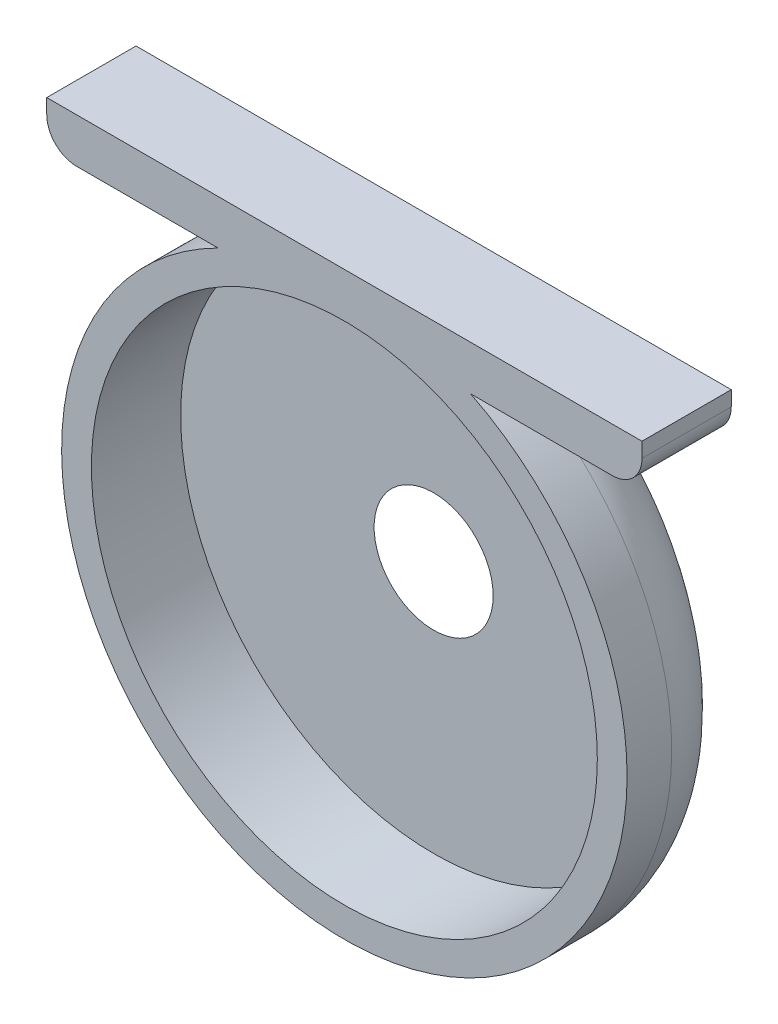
ISO-10303-21;
HEADER;
FILE_DESCRIPTION(('STEP AP214'),'2;1');
FILE_NAME('part.step','',(''),(''),'','','');
FILE_SCHEMA(('AUTOMOTIVE_DESIGN { 1 0 10303 214 1 1 1 1 }'));
ENDSEC;
DATA;
#1=APPLICATION_CONTEXT('core data for automotive mechanical design processes');
#2=APPLICATION_PROTOCOL_DEFINITION('international standard','automotive_design',2000,#1);
#3=PRODUCT_CONTEXT('',#1,'mechanical');
#4=PRODUCT('Part','Part','',(#3));
#5=PRODUCT_RELATED_PRODUCT_CATEGORY('part','',(#4));
#6=PRODUCT_DEFINITION_FORMATION('','',#4);
#7=PRODUCT_DEFINITION_CONTEXT('part definition',#1,'design');
#8=PRODUCT_DEFINITION('design','',#6,#7);
#9=PRODUCT_DEFINITION_SHAPE('','',#8);
#10=(LENGTH_UNIT() NAMED_UNIT(*) SI_UNIT(.MILLI.,.METRE.));
#11=(NAMED_UNIT(*) PLANE_ANGLE_UNIT() SI_UNIT($,.RADIAN.));
#12=(NAMED_UNIT(*) SI_UNIT($,.STERADIAN.) SOLID_ANGLE_UNIT());
#13=UNCERTAINTY_MEASURE_WITH_UNIT(LENGTH_MEASURE(1.E-05),#10,'distance_accuracy_value','');
#14=(GEOMETRIC_REPRESENTATION_CONTEXT(3) GLOBAL_UNCERTAINTY_ASSIGNED_CONTEXT((#13)) GLOBAL_UNIT_ASSIGNED_CONTEXT((#10,
#11,#12)) REPRESENTATION_CONTEXT('',''));
#15=CARTESIAN_POINT('',(0.,0.,0.));
#16=DIRECTION('',(0.,0.,1.));
#17=DIRECTION('',(1.,0.,0.));
#18=AXIS2_PLACEMENT_3D('',#15,#16,#17);
#19=CARTESIAN_POINT('',(0.,0.,6.));
#20=DIRECTION('',(0.,0.,1.));
#21=DIRECTION('',(1.,0.,0.));
#22=AXIS2_PLACEMENT_3D('',#19,#20,#21);
#23=PLANE('',#22);
#24=CARTESIAN_POINT('',(0.,0.,6.));
#25=DIRECTION('',(0.,0.,1.));
#26=DIRECTION('',(1.,0.,0.));
#27=AXIS2_PLACEMENT_3D('',#24,#25,#26);
#28=CIRCLE('',#27,17.);
#29=CARTESIAN_POINT('',(17.,0.,6.));
#30=VERTEX_POINT('',#29);
#31=EDGE_CURVE('E148',#30,#30,#28,.T.);
#32=ORIENTED_EDGE('',*,*,#31,.F.);
#33=EDGE_LOOP('',(#32));
#34=FACE_BOUND('',#33,.T.);
#35=DIRECTION('',(0.,1.,0.));
#36=VECTOR('',#35,1.);
#37=CARTESIAN_POINT('',(-20.,17.,6.));
#38=LINE('',#37,#36);
#39=CARTESIAN_POINT('',(-20.,19.,6.));
#40=VERTEX_POINT('',#39);
#41=CARTESIAN_POINT('',(-20.,20.,6.));
#42=VERTEX_POINT('',#41);
#43=EDGE_CURVE('E102',#40,#42,#38,.T.);
#44=ORIENTED_EDGE('',*,*,#43,.F.);
#45=CARTESIAN_POINT('',(-18.,19.,6.));
#46=DIRECTION('',(0.,0.,1.));
#47=DIRECTION('',(1.,0.,0.));
#48=AXIS2_PLACEMENT_3D('',#45,#46,#47);
#49=CIRCLE('',#48,2.);
#50=CARTESIAN_POINT('',(-18.,17.,6.));
#51=VERTEX_POINT('',#50);
#52=EDGE_CURVE('E55',#40,#51,#49,.T.);
#53=ORIENTED_EDGE('',*,*,#52,.T.);
#54=DIRECTION('',(1.,0.,0.));
#55=VECTOR('',#54,1.);
#56=CARTESIAN_POINT('',(-20.,17.,6.));
#57=LINE('',#56,#55);
#58=CARTESIAN_POINT('',(-8.48528137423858,17.,6.));
#59=VERTEX_POINT('',#58);
#60=EDGE_CURVE('E133',#51,#59,#57,.T.);
#61=ORIENTED_EDGE('',*,*,#60,.T.);
#62=CARTESIAN_POINT('',(0.,0.,6.));
#63=DIRECTION('',(0.,0.,1.));
#64=DIRECTION('',(1.,0.,0.));
#65=AXIS2_PLACEMENT_3D('',#62,#63,#64);
#66=CIRCLE('',#65,19.);
#67=CARTESIAN_POINT('',(8.48528137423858,17.,6.));
#68=VERTEX_POINT('',#67);
#69=EDGE_CURVE('E151',#59,#68,#66,.T.);
#70=ORIENTED_EDGE('',*,*,#69,.T.);
#71=CARTESIAN_POINT('',(18.,17.,6.));
#72=VERTEX_POINT('',#71);
#73=EDGE_CURVE('E132',#68,#72,#57,.T.);
#74=ORIENTED_EDGE('',*,*,#73,.T.);
#75=CARTESIAN_POINT('',(18.,19.,6.));
#76=DIRECTION('',(0.,0.,1.));
#77=DIRECTION('',(1.,0.,0.));
#78=AXIS2_PLACEMENT_3D('',#75,#76,#77);
#79=CIRCLE('',#78,2.);
#80=CARTESIAN_POINT('',(20.,19.,6.));
#81=VERTEX_POINT('',#80);
#82=EDGE_CURVE('E201',#72,#81,#79,.T.);
#83=ORIENTED_EDGE('',*,*,#82,.T.);
#84=DIRECTION('',(0.,1.,0.));
#85=VECTOR('',#84,1.);
#86=CARTESIAN_POINT('',(20.,17.,6.));
#87=LINE('',#86,#85);
#88=CARTESIAN_POINT('',(20.,20.,6.));
#89=VERTEX_POINT('',#88);
#90=EDGE_CURVE('E110',#81,#89,#87,.T.);
#91=ORIENTED_EDGE('',*,*,#90,.T.);
#92=DIRECTION('',(1.,0.,0.));
#93=VECTOR('',#92,1.);
#94=CARTESIAN_POINT('',(-20.,20.,6.));
#95=LINE('',#94,#93);
#96=EDGE_CURVE('E114',#42,#89,#95,.T.);
#97=ORIENTED_EDGE('',*,*,#96,.F.);
#98=EDGE_LOOP('',(#44,#53,#61,#70,#74,#83,#91,#97));
#99=FACE_BOUND('',#98,.T.);
#100=ADVANCED_FACE('F33',(#34,#99),#23,.T.);
#101=CARTESIAN_POINT('',(0.,0.,0.));
#102=DIRECTION('',(0.,0.,1.));
#103=DIRECTION('',(1.,0.,0.));
#104=AXIS2_PLACEMENT_3D('',#101,#102,#103);
#105=PLANE('',#104);
#106=DIRECTION('',(-1.,0.,0.));
#107=VECTOR('',#106,1.);
#108=CARTESIAN_POINT('',(-20.,17.,0.));
#109=LINE('',#108,#107);
#110=CARTESIAN_POINT('',(-5.91607978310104,17.,0.));
#111=VERTEX_POINT('',#110);
#112=CARTESIAN_POINT('',(-18.,17.,0.));
#113=VERTEX_POINT('',#112);
#114=EDGE_CURVE('E135',#111,#113,#109,.T.);
#115=ORIENTED_EDGE('',*,*,#114,.T.);
#116=CARTESIAN_POINT('',(-18.,19.,0.));
#117=DIRECTION('',(0.,0.,1.));
#118=DIRECTION('',(1.,0.,0.));
#119=AXIS2_PLACEMENT_3D('',#116,#117,#118);
#120=CIRCLE('',#119,2.);
#121=CARTESIAN_POINT('',(-20.,19.,0.));
#122=VERTEX_POINT('',#121);
#123=EDGE_CURVE('E11',#113,#122,#120,.F.);
#124=ORIENTED_EDGE('',*,*,#123,.T.);
#125=DIRECTION('',(0.,1.,0.));
#126=VECTOR('',#125,1.);
#127=CARTESIAN_POINT('',(-20.,17.,0.));
#128=LINE('',#127,#126);
#129=CARTESIAN_POINT('',(-20.,20.,0.));
#130=VERTEX_POINT('',#129);
#131=EDGE_CURVE('E137',#122,#130,#128,.T.);
#132=ORIENTED_EDGE('',*,*,#131,.T.);
#133=DIRECTION('',(-1.,0.,0.));
#134=VECTOR('',#133,1.);
#135=CARTESIAN_POINT('',(-20.,20.,0.));
#136=LINE('',#135,#134);
#137=CARTESIAN_POINT('',(20.,20.,0.));
#138=VERTEX_POINT('',#137);
#139=EDGE_CURVE('E124',#138,#130,#136,.T.);
#140=ORIENTED_EDGE('',*,*,#139,.F.);
#141=DIRECTION('',(0.,1.,0.));
#142=VECTOR('',#141,1.);
#143=CARTESIAN_POINT('',(20.,17.,0.));
#144=LINE('',#143,#142);
#145=CARTESIAN_POINT('',(20.,19.,0.));
#146=VERTEX_POINT('',#145);
#147=EDGE_CURVE('E140',#146,#138,#144,.T.);
#148=ORIENTED_EDGE('',*,*,#147,.F.);
#149=CARTESIAN_POINT('',(18.,19.,0.));
#150=DIRECTION('',(0.,0.,1.));
#151=DIRECTION('',(1.,0.,0.));
#152=AXIS2_PLACEMENT_3D('',#149,#150,#151);
#153=CIRCLE('',#152,2.);
#154=CARTESIAN_POINT('',(18.,17.,0.));
#155=VERTEX_POINT('',#154);
#156=EDGE_CURVE('E197',#146,#155,#153,.F.);
#157=ORIENTED_EDGE('',*,*,#156,.T.);
#158=CARTESIAN_POINT('',(5.91607978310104,17.,0.));
#159=VERTEX_POINT('',#158);
#160=EDGE_CURVE('E111',#155,#159,#109,.T.);
#161=ORIENTED_EDGE('',*,*,#160,.T.);
#162=CARTESIAN_POINT('',(0.,0.,0.));
#163=DIRECTION('',(0.,0.,1.));
#164=DIRECTION('',(1.,0.,0.));
#165=AXIS2_PLACEMENT_3D('',#162,#163,#164);
#166=CIRCLE('',#165,18.0000000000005);
#167=EDGE_CURVE('E173',#159,#111,#166,.T.);
#168=ORIENTED_EDGE('',*,*,#167,.T.);
#169=EDGE_LOOP('',(#115,#124,#132,#140,#148,#157,#161,#168));
#170=FACE_BOUND('',#169,.T.);
#171=ADVANCED_FACE('F215',(#170),#105,.F.);
#172=CARTESIAN_POINT('',(0.,0.,6.));
#173=DIRECTION('',(0.,0.,-1.));
#174=DIRECTION('',(-1.,0.,0.));
#175=AXIS2_PLACEMENT_3D('',#172,#173,#174);
#176=CYLINDRICAL_SURFACE('',#175,19.);
#177=DIRECTION('',(0.,0.,-1.));
#178=VECTOR('',#177,1.);
#179=CARTESIAN_POINT('',(-8.48528137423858,17.,6.));
#180=LINE('',#179,#178);
#181=CARTESIAN_POINT('',(-8.48528137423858,17.,3.));
#182=VERTEX_POINT('',#181);
#183=EDGE_CURVE('E144',#59,#182,#180,.T.);
#184=ORIENTED_EDGE('',*,*,#183,.T.);
#185=CARTESIAN_POINT('',(0.,0.,3.));
#186=DIRECTION('',(0.,0.,1.));
#187=DIRECTION('',(1.,0.,0.));
#188=AXIS2_PLACEMENT_3D('',#185,#186,#187);
#189=CIRCLE('',#188,19.);
#190=CARTESIAN_POINT('',(8.48528137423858,17.,3.));
#191=VERTEX_POINT('',#190);
#192=EDGE_CURVE('E159',#182,#191,#189,.T.);
#193=ORIENTED_EDGE('',*,*,#192,.T.);
#194=DIRECTION('',(0.,0.,-1.));
#195=VECTOR('',#194,1.);
#196=CARTESIAN_POINT('',(8.48528137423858,17.,6.));
#197=LINE('',#196,#195);
#198=EDGE_CURVE('E139',#191,#68,#197,.F.);
#199=ORIENTED_EDGE('',*,*,#198,.T.);
#200=ORIENTED_EDGE('',*,*,#69,.F.);
#201=EDGE_LOOP('',(#184,#193,#199,#200));
#202=FACE_BOUND('',#201,.T.);
#203=ADVANCED_FACE('F235',(#202),#176,.T.);
#204=CARTESIAN_POINT('',(0.,0.,6.));
#205=DIRECTION('',(0.,0.,-1.));
#206=DIRECTION('',(-1.,0.,0.));
#207=AXIS2_PLACEMENT_3D('',#204,#205,#206);
#208=CYLINDRICAL_SURFACE('',#207,17.);
#209=CARTESIAN_POINT('',(0.,0.,0.));
#210=DIRECTION('',(0.,0.,1.));
#211=DIRECTION('',(1.,0.,0.));
#212=AXIS2_PLACEMENT_3D('',#209,#210,#211);
#213=CIRCLE('',#212,17.);
#214=CARTESIAN_POINT('',(17.,0.,0.));
#215=VERTEX_POINT('',#214);
#216=EDGE_CURVE('E147',#215,#215,#213,.T.);
#217=ORIENTED_EDGE('',*,*,#216,.F.);
#218=EDGE_LOOP('',(#217));
#219=FACE_BOUND('',#218,.T.);
#220=ORIENTED_EDGE('',*,*,#31,.T.);
#221=EDGE_LOOP('',(#220));
#222=FACE_BOUND('',#221,.T.);
#223=ADVANCED_FACE('F184',(#219,#222),#208,.F.);
#224=CARTESIAN_POINT('',(0.,17.,0.));
#225=DIRECTION('',(0.,-1.,0.));
#226=DIRECTION('',(0.,0.,-1.));
#227=AXIS2_PLACEMENT_3D('',#224,#225,#226);
#228=PLANE('',#227);
#229=ORIENTED_EDGE('',*,*,#60,.F.);
#230=DIRECTION('',(0.,0.,1.));
#231=VECTOR('',#230,1.);
#232=CARTESIAN_POINT('',(-18.,17.,0.));
#233=LINE('',#232,#231);
#234=EDGE_CURVE('E41',#51,#113,#233,.F.);
#235=ORIENTED_EDGE('',*,*,#234,.T.);
#236=ORIENTED_EDGE('',*,*,#114,.F.);
#237=CARTESIAN_POINT('',(-5.91607978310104,17.,0.));
#238=CARTESIAN_POINT('',(-6.04115061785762,17.,0.0548402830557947));
#239=CARTESIAN_POINT('',(-6.16487037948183,17.,0.112928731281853));
#240=CARTESIAN_POINT('',(-6.40892950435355,17.,0.236508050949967));
#241=CARTESIAN_POINT('',(-6.52925971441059,17.,0.302016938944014));
#242=CARTESIAN_POINT('',(-6.76715348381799,17.,0.442211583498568));
#243=CARTESIAN_POINT('',(-6.88464000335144,17.,0.5170294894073));
#244=CARTESIAN_POINT('',(-7.11317187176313,17.,0.675730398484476));
#245=CARTESIAN_POINT('',(-7.22422364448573,17.,0.759604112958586));
#246=CARTESIAN_POINT('',(-7.47230344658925,17.,0.965678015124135));
#247=CARTESIAN_POINT('',(-7.60632686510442,17.,1.09157255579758));
#248=CARTESIAN_POINT('',(-7.85369385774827,17.,1.36158809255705));
#249=CARTESIAN_POINT('',(-7.96713209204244,17.,1.50562021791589));
#250=CARTESIAN_POINT('',(-8.14462595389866,17.,1.77888382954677));
#251=CARTESIAN_POINT('',(-8.2140555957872,17.,1.90459886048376));
#252=CARTESIAN_POINT('',(-8.33136189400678,17.,2.16569931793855));
#253=CARTESIAN_POINT('',(-8.37927661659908,17.,2.30106716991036));
#254=CARTESIAN_POINT('',(-8.43773474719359,17.,2.5309710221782));
#255=CARTESIAN_POINT('',(-8.45544775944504,17.,2.62371658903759));
#256=CARTESIAN_POINT('',(-8.47927282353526,17.,2.81094129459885));
#257=CARTESIAN_POINT('',(-8.48535224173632,17.,2.90542456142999));
#258=CARTESIAN_POINT('',(-8.48528137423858,17.,3.));
#259=B_SPLINE_CURVE_WITH_KNOTS('',3,(#237,#238,#239,#240,#241,#242,#243,#244,#245,#246,#247,
#248,#249,#250,#251,#252,#253,#254,#255,#256,#257,#258),.UNSPECIFIED.,.F.,.F.,(4,2,2,2,2,2,2,2,
2,2,4),(0.,0.409750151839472,0.820517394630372,1.23797847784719,1.65501536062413,
2.20499679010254,2.75238125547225,3.18160653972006,3.61006937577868,3.89264815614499,
4.17601844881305),.UNSPECIFIED.);
#260=EDGE_CURVE('E189',#111,#182,#259,.T.);
#261=ORIENTED_EDGE('',*,*,#260,.T.);
#262=ORIENTED_EDGE('',*,*,#183,.F.);
#263=EDGE_LOOP('',(#229,#235,#236,#261,#262));
#264=FACE_BOUND('',#263,.T.);
#265=ADVANCED_FACE('F178',(#264),#228,.T.);
#266=ORIENTED_EDGE('',*,*,#160,.F.);
#267=DIRECTION('',(0.,0.,-1.));
#268=VECTOR('',#267,1.);
#269=CARTESIAN_POINT('',(18.,17.,0.));
#270=LINE('',#269,#268);
#271=EDGE_CURVE('E199',#155,#72,#270,.F.);
#272=ORIENTED_EDGE('',*,*,#271,.T.);
#273=ORIENTED_EDGE('',*,*,#73,.F.);
#274=ORIENTED_EDGE('',*,*,#198,.F.);
#275=CARTESIAN_POINT('',(8.48528137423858,17.,3.));
#276=CARTESIAN_POINT('',(8.48530327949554,17.,2.93329421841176));
#277=CARTESIAN_POINT('',(8.48229305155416,17.,2.86660007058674));
#278=CARTESIAN_POINT('',(8.47037631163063,17.,2.7337872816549));
#279=CARTESIAN_POINT('',(8.46147404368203,17.,2.6676682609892));
#280=CARTESIAN_POINT('',(8.43803132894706,17.,2.53696546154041));
#281=CARTESIAN_POINT('',(8.42353480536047,17.,2.47237378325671));
#282=CARTESIAN_POINT('',(8.38920466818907,17.,2.34463435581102));
#283=CARTESIAN_POINT('',(8.36937032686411,17.,2.28148680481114));
#284=CARTESIAN_POINT('',(8.30249804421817,17.,2.09509611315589));
#285=CARTESIAN_POINT('',(8.24800785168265,17.,1.97446226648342));
#286=CARTESIAN_POINT('',(8.12245158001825,17.,1.7421514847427));
#287=CARTESIAN_POINT('',(8.05135951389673,17.,1.63048896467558));
#288=CARTESIAN_POINT('',(7.84977058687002,17.,1.35350519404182));
#289=CARTESIAN_POINT('',(7.70904522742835,17.,1.19562745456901));
#290=CARTESIAN_POINT('',(7.40428663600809,17.,0.903308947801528));
#291=CARTESIAN_POINT('',(7.24013269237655,17.,0.76899813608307));
#292=CARTESIAN_POINT('',(6.978247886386,17.,0.580655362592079));
#293=CARTESIAN_POINT('',(6.88598717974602,17.,0.518786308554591));
#294=CARTESIAN_POINT('',(6.69797168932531,17.,0.400527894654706));
#295=CARTESIAN_POINT('',(6.60221593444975,17.,0.344140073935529));
#296=CARTESIAN_POINT('',(6.40925849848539,17.,0.237199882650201));
#297=CARTESIAN_POINT('',(6.31209540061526,17.,0.186577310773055));
#298=CARTESIAN_POINT('',(6.11560991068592,17.,0.0899429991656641));
#299=CARTESIAN_POINT('',(6.01628960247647,17.,0.0439270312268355));
#300=CARTESIAN_POINT('',(5.9160797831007,17.,4.70015516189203E-13));
#301=B_SPLINE_CURVE_WITH_KNOTS('',3,(#275,#276,#277,#278,#279,#280,#281,#282,#283,#284,#285,
#286,#287,#288,#289,#290,#291,#292,#293,#294,#295,#296,#297,#298,#299,#300),.UNSPECIFIED.,.F.,
.F.,(4,2,2,2,2,2,2,2,2,2,2,2,4),(0.,0.200030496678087,0.399917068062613,0.598265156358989,
0.796640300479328,1.19205550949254,1.58809386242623,2.21896850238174,2.85321954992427,
3.18631555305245,3.51950482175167,3.84806406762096,4.17631892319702),.UNSPECIFIED.);
#302=EDGE_CURVE('E165',#191,#159,#301,.T.);
#303=ORIENTED_EDGE('',*,*,#302,.T.);
#304=EDGE_LOOP('',(#266,#272,#273,#274,#303));
#305=FACE_BOUND('',#304,.T.);
#306=ADVANCED_FACE('F183',(#305),#228,.T.);
#307=CARTESIAN_POINT('',(-20.,17.,6.));
#308=DIRECTION('',(-1.,0.,0.));
#309=DIRECTION('',(0.,0.,1.));
#310=AXIS2_PLACEMENT_3D('',#307,#308,#309);
#311=PLANE('',#310);
#312=ORIENTED_EDGE('',*,*,#131,.F.);
#313=DIRECTION('',(0.,0.,1.));
#314=VECTOR('',#313,1.);
#315=CARTESIAN_POINT('',(-20.,19.,6.));
#316=LINE('',#315,#314);
#317=EDGE_CURVE('E109',#122,#40,#316,.T.);
#318=ORIENTED_EDGE('',*,*,#317,.T.);
#319=ORIENTED_EDGE('',*,*,#43,.T.);
#320=DIRECTION('',(0.,0.,1.));
#321=VECTOR('',#320,1.);
#322=CARTESIAN_POINT('',(-20.,20.,6.));
#323=LINE('',#322,#321);
#324=EDGE_CURVE('E107',#130,#42,#323,.T.);
#325=ORIENTED_EDGE('',*,*,#324,.F.);
#326=EDGE_LOOP('',(#312,#318,#319,#325));
#327=FACE_BOUND('',#326,.T.);
#328=ADVANCED_FACE('F105',(#327),#311,.T.);
#329=CARTESIAN_POINT('',(20.,17.,6.));
#330=DIRECTION('',(1.,0.,0.));
#331=DIRECTION('',(0.,0.,-1.));
#332=AXIS2_PLACEMENT_3D('',#329,#330,#331);
#333=PLANE('',#332);
#334=ORIENTED_EDGE('',*,*,#90,.F.);
#335=DIRECTION('',(0.,0.,-1.));
#336=VECTOR('',#335,1.);
#337=CARTESIAN_POINT('',(20.,19.,6.));
#338=LINE('',#337,#336);
#339=EDGE_CURVE('E194',#81,#146,#338,.T.);
#340=ORIENTED_EDGE('',*,*,#339,.T.);
#341=ORIENTED_EDGE('',*,*,#147,.T.);
#342=DIRECTION('',(0.,0.,-1.));
#343=VECTOR('',#342,1.);
#344=CARTESIAN_POINT('',(20.,20.,6.));
#345=LINE('',#344,#343);
#346=EDGE_CURVE('E119',#89,#138,#345,.T.);
#347=ORIENTED_EDGE('',*,*,#346,.F.);
#348=EDGE_LOOP('',(#334,#340,#341,#347));
#349=FACE_BOUND('',#348,.T.);
#350=ADVANCED_FACE('F186',(#349),#333,.T.);
#351=CARTESIAN_POINT('',(0.,20.,0.));
#352=DIRECTION('',(0.,-1.,0.));
#353=DIRECTION('',(0.,0.,-1.));
#354=AXIS2_PLACEMENT_3D('',#351,#352,#353);
#355=PLANE('',#354);
#356=ORIENTED_EDGE('',*,*,#324,.T.);
#357=ORIENTED_EDGE('',*,*,#96,.T.);
#358=ORIENTED_EDGE('',*,*,#346,.T.);
#359=ORIENTED_EDGE('',*,*,#139,.T.);
#360=EDGE_LOOP('',(#356,#357,#358,#359));
#361=FACE_BOUND('',#360,.T.);
#362=ADVANCED_FACE('F122',(#361),#355,.F.);
#363=CARTESIAN_POINT('',(0.,0.,-2.));
#364=DIRECTION('',(0.,0.,1.));
#365=DIRECTION('',(1.,0.,0.));
#366=AXIS2_PLACEMENT_3D('',#363,#364,#365);
#367=PLANE('',#366);
#368=CARTESIAN_POINT('',(0.,0.,-2.));
#369=DIRECTION('',(0.,0.,1.));
#370=DIRECTION('',(1.,0.,0.));
#371=AXIS2_PLACEMENT_3D('',#368,#369,#370);
#372=CIRCLE('',#371,14.);
#373=CARTESIAN_POINT('',(14.,0.,-2.));
#374=VERTEX_POINT('',#373);
#375=EDGE_CURVE('E162',#374,#374,#372,.F.);
#376=ORIENTED_EDGE('',*,*,#375,.T.);
#377=EDGE_LOOP('',(#376));
#378=FACE_BOUND('',#377,.T.);
#379=CARTESIAN_POINT('',(0.,0.,-2.));
#380=DIRECTION('',(0.,0.,1.));
#381=DIRECTION('',(1.,0.,0.));
#382=AXIS2_PLACEMENT_3D('',#379,#380,#381);
#383=CIRCLE('',#382,10.);
#384=CARTESIAN_POINT('',(10.,0.,-2.));
#385=VERTEX_POINT('',#384);
#386=EDGE_CURVE('E156',#385,#385,#383,.T.);
#387=ORIENTED_EDGE('',*,*,#386,.T.);
#388=EDGE_LOOP('',(#387));
#389=FACE_BOUND('',#388,.T.);
#390=ADVANCED_FACE('F251',(#378,#389),#367,.F.);
#391=CARTESIAN_POINT('',(0.,0.,0.));
#392=DIRECTION('',(0.,0.,1.));
#393=DIRECTION('',(1.,0.,0.));
#394=AXIS2_PLACEMENT_3D('',#391,#392,#393);
#395=PLANE('',#394);
#396=CARTESIAN_POINT('',(0.,0.,0.));
#397=DIRECTION('',(0.,0.,1.));
#398=DIRECTION('',(1.,0.,0.));
#399=AXIS2_PLACEMENT_3D('',#396,#397,#398);
#400=CIRCLE('',#399,4.);
#401=CARTESIAN_POINT('',(4.,0.,0.));
#402=VERTEX_POINT('',#401);
#403=EDGE_CURVE('E125',#402,#402,#400,.T.);
#404=ORIENTED_EDGE('',*,*,#403,.F.);
#405=EDGE_LOOP('',(#404));
#406=FACE_BOUND('',#405,.T.);
#407=ORIENTED_EDGE('',*,*,#216,.T.);
#408=EDGE_LOOP('',(#407));
#409=FACE_BOUND('',#408,.T.);
#410=ADVANCED_FACE('F244',(#406,#409),#395,.T.);
#411=CARTESIAN_POINT('',(0.,0.,8.));
#412=DIRECTION('',(0.,0.,1.));
#413=DIRECTION('',(1.,0.,0.));
#414=AXIS2_PLACEMENT_3D('',#411,#412,#413);
#415=TOROIDAL_SURFACE('',#414,10.,10.);
#416=ORIENTED_EDGE('',*,*,#403,.T.);
#417=EDGE_LOOP('',(#416));
#418=FACE_BOUND('',#417,.T.);
#419=ORIENTED_EDGE('',*,*,#386,.F.);
#420=EDGE_LOOP('',(#419));
#421=FACE_BOUND('',#420,.T.);
#422=ADVANCED_FACE('F242',(#418,#421),#415,.T.);
#423=CARTESIAN_POINT('',(0.,0.,3.));
#424=DIRECTION('',(0.,0.,1.));
#425=DIRECTION('',(1.,0.,0.));
#426=AXIS2_PLACEMENT_3D('',#423,#424,#425);
#427=TOROIDAL_SURFACE('',#426,14.,5.);
#428=ORIENTED_EDGE('',*,*,#375,.F.);
#429=EDGE_LOOP('',(#428));
#430=FACE_BOUND('',#429,.T.);
#431=ORIENTED_EDGE('',*,*,#302,.F.);
#432=ORIENTED_EDGE('',*,*,#192,.F.);
#433=ORIENTED_EDGE('',*,*,#260,.F.);
#434=ORIENTED_EDGE('',*,*,#167,.F.);
#435=EDGE_LOOP('',(#431,#432,#433,#434));
#436=FACE_BOUND('',#435,.T.);
#437=ADVANCED_FACE('F175',(#430,#436),#427,.T.);
#438=CARTESIAN_POINT('',(18.,19.,5.99999999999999));
#439=DIRECTION('',(0.,0.,-1.));
#440=DIRECTION('',(-1.,0.,0.));
#441=AXIS2_PLACEMENT_3D('',#438,#439,#440);
#442=CYLINDRICAL_SURFACE('',#441,2.);
#443=ORIENTED_EDGE('',*,*,#82,.F.);
#444=ORIENTED_EDGE('',*,*,#271,.F.);
#445=ORIENTED_EDGE('',*,*,#156,.F.);
#446=ORIENTED_EDGE('',*,*,#339,.F.);
#447=EDGE_LOOP('',(#443,#444,#445,#446));
#448=FACE_BOUND('',#447,.T.);
#449=ADVANCED_FACE('F212',(#448),#442,.T.);
#450=CARTESIAN_POINT('',(-18.,19.,6.));
#451=DIRECTION('',(0.,0.,1.));
#452=DIRECTION('',(1.,0.,0.));
#453=AXIS2_PLACEMENT_3D('',#450,#451,#452);
#454=CYLINDRICAL_SURFACE('',#453,2.);
#455=ORIENTED_EDGE('',*,*,#123,.F.);
#456=ORIENTED_EDGE('',*,*,#234,.F.);
#457=ORIENTED_EDGE('',*,*,#52,.F.);
#458=ORIENTED_EDGE('',*,*,#317,.F.);
#459=EDGE_LOOP('',(#455,#456,#457,#458));
#460=FACE_BOUND('',#459,.T.);
#461=ADVANCED_FACE('F35',(#460),#454,.T.);
#462=CLOSED_SHELL('',(#100,#171,#203,#223,#265,#306,#328,#350,#362,#390,#410,#422,#437,#449,#461));
#463=MANIFOLD_SOLID_BREP('B2',#462);
#464=ADVANCED_BREP_SHAPE_REPRESENTATION('',(#18,#463),#14);
#465=SHAPE_DEFINITION_REPRESENTATION(#9,#464);
ENDSEC;
END-ISO-10303-21;
